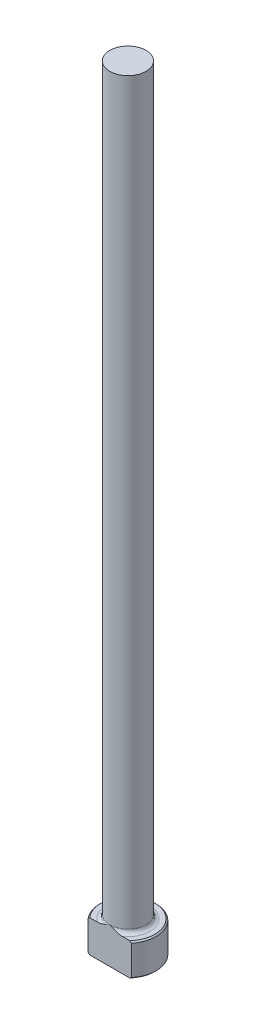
from build123d import *

# Parameters (mm, degrees)
CHAMFER1_SIZE = 0.254
FILLET1_R     = 0.762
KEY_DEPTH     = 153.60197502


with BuildPart() as part:
    # Sketch1 → Revolve1 (revolve)
    with BuildSketch(Plane.XY, mode=Mode.PRIVATE) as revolve1_sk:
        Polygon((0, 0), (-5.5499, 0), (-5.5499, 6.35), (-3.57124, 6.35), (-3.57124, 152.4), (0, 152.4), align=None)
    revolve(revolve1_sk.sketch.rotate(Axis((0, 259.958771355, 0), (0, -1, 0)), 270), axis=Axis((0, 259.958771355, 0), (0, -1, 0)))

    # Chamfer1
    chamfer1_edges = [part.edges().sort_by_distance(p)[0] for p in [
        (0, 6.35, -5.5499),
        (0, 0, -5.5499),
    ]]
    chamfer(chamfer1_edges, length=CHAMFER1_SIZE)

    # Fillet1
    fillet1_edges = [part.edges().sort_by_distance(p)[0] for p in [
        (0, 6.35, -3.57124),
    ]]
    fillet(fillet1_edges, radius=FILLET1_R)

    # Sketch2 → KEY (cut, through all)
    with BuildSketch(Plane.XZ):
        with BuildLine():
            Line((-4.248250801, 3.57124), (4.248250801, 3.57124))
            ThreePointArc((4.248250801, 3.57124), (0, 5.5499), (-4.248250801, 3.57124))
        make_face()
    extrude(amount=-KEY_DEPTH, mode=Mode.SUBTRACT)


solid = part.part
